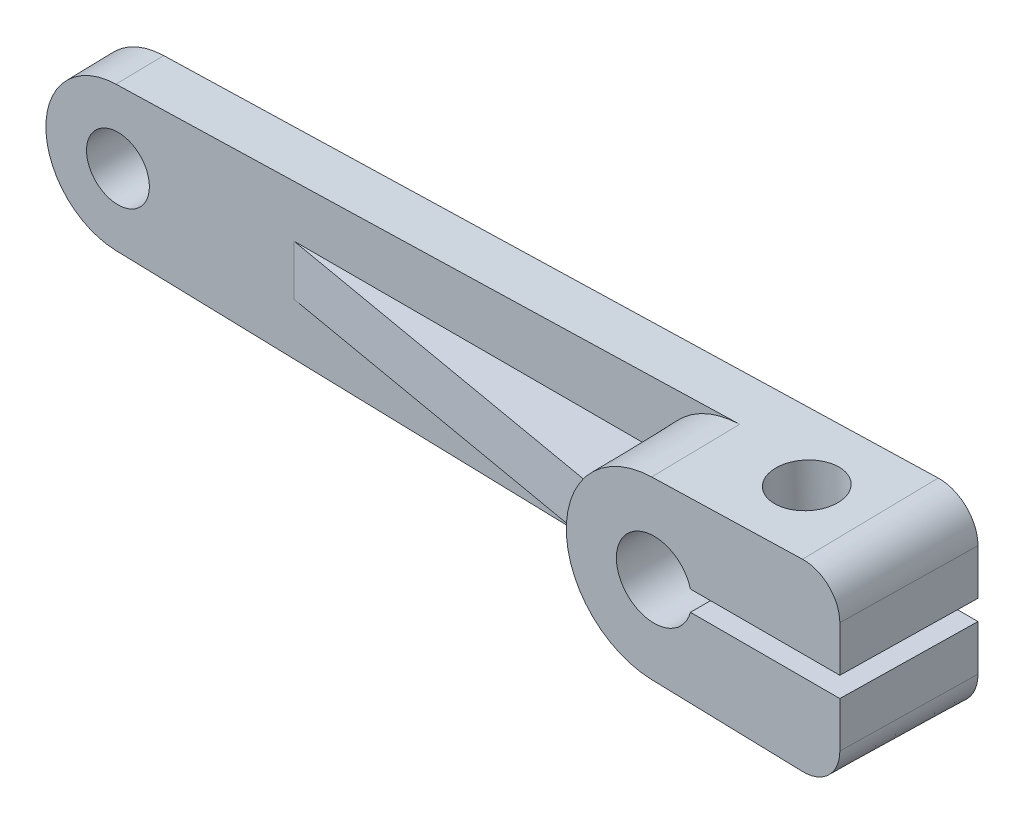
from build123d import *

# Parameters (mm, degrees)
BASE_EXTRUSION_DEPTH    = 1.9
BASE_EXTRUSION_TAPER    = 1
BOSS_EXTRU_1_DEPTH      = 3.5
BOSS_EXTRU_1_TAPER      = 1
ESQUISSE3_R             = 1.25
ENL_V_MAT_EXTRU_1_DEPTH = 33.962355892
NERVURE2_REACH          = 34.962
ESQUISSE4_WALL_W        = 82.451915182
ESQUISSE4_WALL_H        = 2
ESQUISSE5_R             = 1.25
ENL_V_MAT_EXTRU_2_DEPTH = 34.485666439


with BuildPart() as part:
    # Esquisse1 → Base-Extrusion (new body)
    with BuildSketch(Plane.XY):
        with BuildLine():
            ThreePointArc((-0.080110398, 2.898893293), (-2.9, 0), (-0.080110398, -2.898893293))
            Line((-0.080110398, -2.898893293), (30.718232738, -3.75))
            ThreePointArc((30.718232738, -3.75), (31.83402651, -3.314683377), (32.3, -2.211340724))
            Line((32.3, -2.211340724), (32.3, 2.211340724))
            ThreePointArc((32.3, 2.211340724), (31.83402651, 3.314683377), (30.718232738, 3.75))
            Line((30.718232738, 3.75), (-0.080110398, 2.898893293))
        make_face()
    extrude(amount=BASE_EXTRUSION_DEPTH, taper=BASE_EXTRUSION_TAPER)

    # Esquisse2 → Boss.-Extru.1 (add)
    with BuildSketch(Plane.XY.offset(1.9)):
        with BuildLine():
            ThreePointArc((24.721151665, 3.551094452), (21.266835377, 0), (24.721151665, -3.551094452))
            Line((24.721151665, -3.551094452), (30.719148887, -3.716848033))
            ThreePointArc((30.719148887, -3.716848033), (31.810901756, -3.290910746), (32.266835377, -2.211340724))
            Line((32.266835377, -2.211340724), (32.266835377, 2.211340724))
            ThreePointArc((32.266835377, 2.211340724), (31.810901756, 3.290910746), (30.719148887, 3.716848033))
            Line((30.719148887, 3.716848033), (24.721151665, 3.551094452))
        make_face()
    extrude(amount=BOSS_EXTRU_1_DEPTH, taper=BOSS_EXTRU_1_TAPER)

    # Esquisse3 → Enl_v. mat.-Extru.1 (cut, through all)
    with BuildSketch(Plane.XY.offset(5.4)):
        Circle(ESQUISSE3_R)
        with BuildLine():
            Line((26.264968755, 0.4), (32.3, 0.4))
            Line((32.3, 0.4), (32.3, -0.4))
            Line((32.3, -0.4), (26.264968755, -0.4))
            ThreePointArc((26.264968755, -0.4), (23.319285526, 0), (26.264968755, 0.4))
        make_face()
    extrude(amount=-ENL_V_MAT_EXTRU_1_DEPTH, mode=Mode.SUBTRACT)

    # Esquisse4 wall → Nervure2 (add, up to next)
    with BuildSketch(Plane(origin=(14.15523652, 0, 3.15), x_dir=(0.985081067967, 0, 0.172090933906), z_dir=(0.172090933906, 0, -0.985081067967)), mode=Mode.PRIVATE) as nervure2_sk1:
        Rectangle(ESQUISSE4_WALL_W, ESQUISSE4_WALL_H)
    nervure2_tool1 = extrude(nervure2_sk1.sketch, amount=NERVURE2_REACH, mode=Mode.PRIVATE) - part.part
    add(nervure2_tool1.solids().sort_by_distance((14.15523652, 0, 3.15))[0])

    # Esquisse5 → Enl_v. mat.-Extru.2 (cut, through all)
    with BuildSketch(Plane(origin=(-0.080085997, 2.898010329, 0.05060427), x_dir=(-0.9996184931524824, -0.027615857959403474, -0.0004822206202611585), z_dir=(-0.02762006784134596, 0.9994661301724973, 0.017452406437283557))):
        with Locations(Location((-28.330762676, 2.685724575, 0), (0, 0, 32.301551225))):
            Circle(ESQUISSE5_R)
    extrude(amount=-ENL_V_MAT_EXTRU_2_DEPTH, mode=Mode.SUBTRACT)


solid = part.part
